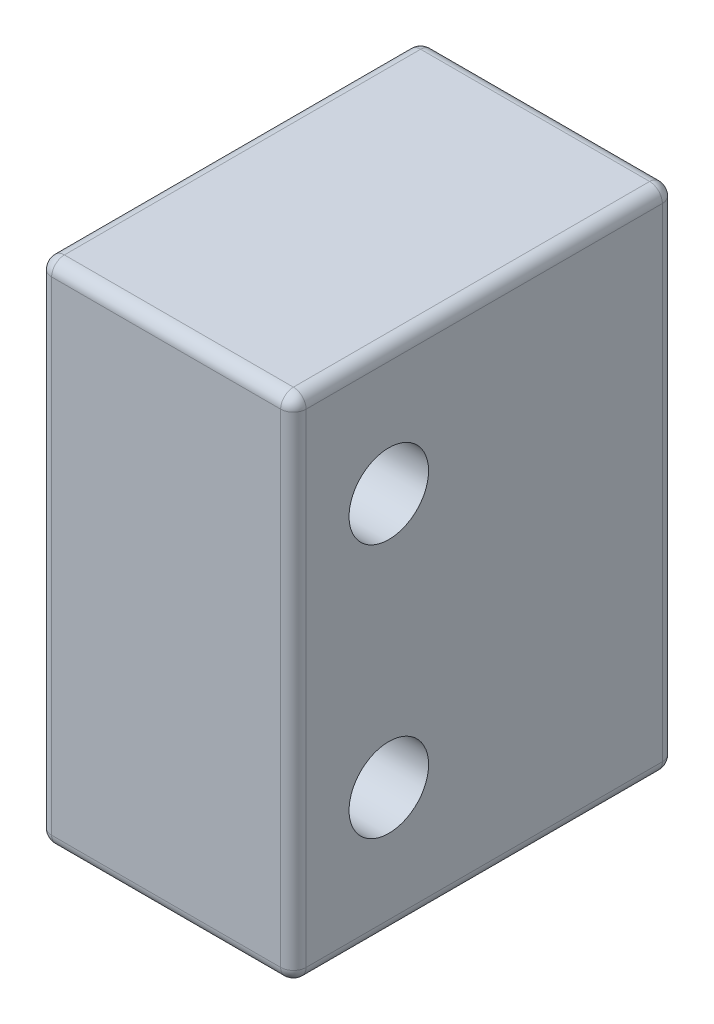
ISO-10303-21;
HEADER;
FILE_DESCRIPTION(('STEP AP214'),'2;1');
FILE_NAME('part.step','',(''),(''),'','','');
FILE_SCHEMA(('AUTOMOTIVE_DESIGN { 1 0 10303 214 1 1 1 1 }'));
ENDSEC;
DATA;
#1=APPLICATION_CONTEXT('core data for automotive mechanical design processes');
#2=APPLICATION_PROTOCOL_DEFINITION('international standard','automotive_design',2000,#1);
#3=PRODUCT_CONTEXT('',#1,'mechanical');
#4=PRODUCT('Part','Part','',(#3));
#5=PRODUCT_RELATED_PRODUCT_CATEGORY('part','',(#4));
#6=PRODUCT_DEFINITION_FORMATION('','',#4);
#7=PRODUCT_DEFINITION_CONTEXT('part definition',#1,'design');
#8=PRODUCT_DEFINITION('design','',#6,#7);
#9=PRODUCT_DEFINITION_SHAPE('','',#8);
#10=(LENGTH_UNIT() NAMED_UNIT(*) SI_UNIT(.MILLI.,.METRE.));
#11=(NAMED_UNIT(*) PLANE_ANGLE_UNIT() SI_UNIT($,.RADIAN.));
#12=(NAMED_UNIT(*) SI_UNIT($,.STERADIAN.) SOLID_ANGLE_UNIT());
#13=UNCERTAINTY_MEASURE_WITH_UNIT(LENGTH_MEASURE(1.E-05),#10,'distance_accuracy_value','');
#14=(GEOMETRIC_REPRESENTATION_CONTEXT(3) GLOBAL_UNCERTAINTY_ASSIGNED_CONTEXT((#13)) GLOBAL_UNIT_ASSIGNED_CONTEXT((#10,
#11,#12)) REPRESENTATION_CONTEXT('',''));
#15=CARTESIAN_POINT('',(0.,0.,0.));
#16=DIRECTION('',(0.,0.,1.));
#17=DIRECTION('',(1.,0.,0.));
#18=AXIS2_PLACEMENT_3D('',#15,#16,#17);
#19=CARTESIAN_POINT('',(50.8,50.8,38.1));
#20=DIRECTION('',(0.,0.,-1.));
#21=DIRECTION('',(0.,1.,0.));
#22=AXIS2_PLACEMENT_3D('',#19,#20,#21);
#23=PLANE('',#22);
#24=DIRECTION('',(0.,-1.,0.));
#25=VECTOR('',#24,1.);
#26=CARTESIAN_POINT('',(2.54,50.8,38.1));
#27=LINE('',#26,#25);
#28=CARTESIAN_POINT('',(2.54,48.26,38.1));
#29=VERTEX_POINT('',#28);
#30=CARTESIAN_POINT('',(2.54,-48.26,38.1));
#31=VERTEX_POINT('',#30);
#32=EDGE_CURVE('E178',#29,#31,#27,.T.);
#33=ORIENTED_EDGE('',*,*,#32,.T.);
#34=DIRECTION('',(-1.,0.,0.));
#35=VECTOR('',#34,1.);
#36=CARTESIAN_POINT('',(50.8,-48.26,38.1));
#37=LINE('',#36,#35);
#38=CARTESIAN_POINT('',(48.26,-48.26,38.1));
#39=VERTEX_POINT('',#38);
#40=EDGE_CURVE('E183',#31,#39,#37,.F.);
#41=ORIENTED_EDGE('',*,*,#40,.T.);
#42=DIRECTION('',(0.,-1.,0.));
#43=VECTOR('',#42,1.);
#44=CARTESIAN_POINT('',(48.26,50.8,38.1));
#45=LINE('',#44,#43);
#46=CARTESIAN_POINT('',(48.26,48.26,38.1));
#47=VERTEX_POINT('',#46);
#48=EDGE_CURVE('E180',#39,#47,#45,.F.);
#49=ORIENTED_EDGE('',*,*,#48,.T.);
#50=DIRECTION('',(-1.,0.,0.));
#51=VECTOR('',#50,1.);
#52=CARTESIAN_POINT('',(50.8,48.26,38.1));
#53=LINE('',#52,#51);
#54=EDGE_CURVE('E176',#47,#29,#53,.T.);
#55=ORIENTED_EDGE('',*,*,#54,.T.);
#56=EDGE_LOOP('',(#33,#41,#49,#55));
#57=FACE_BOUND('',#56,.T.);
#58=ADVANCED_FACE('F30',(#57),#23,.F.);
#59=CARTESIAN_POINT('',(50.8,-50.8,38.1));
#60=DIRECTION('',(0.,1.,0.));
#61=DIRECTION('',(0.,0.,1.));
#62=AXIS2_PLACEMENT_3D('',#59,#60,#61);
#63=PLANE('',#62);
#64=CARTESIAN_POINT('',(25.4,-50.8,16.51));
#65=DIRECTION('',(0.,-1.,0.));
#66=DIRECTION('',(0.,0.,-1.));
#67=AXIS2_PLACEMENT_3D('',#64,#65,#66);
#68=CIRCLE('',#67,7.9375);
#69=CARTESIAN_POINT('',(25.4,-50.8,8.57249999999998));
#70=VERTEX_POINT('',#69);
#71=EDGE_CURVE('E610',#70,#70,#68,.T.);
#72=ORIENTED_EDGE('',*,*,#71,.F.);
#73=EDGE_LOOP('',(#72));
#74=FACE_BOUND('',#73,.T.);
#75=DIRECTION('',(0.,0.,-1.));
#76=VECTOR('',#75,1.);
#77=CARTESIAN_POINT('',(48.26,-50.8,38.1));
#78=LINE('',#77,#76);
#79=CARTESIAN_POINT('',(48.26,-50.8,-35.56));
#80=VERTEX_POINT('',#79);
#81=CARTESIAN_POINT('',(48.26,-50.8,35.56));
#82=VERTEX_POINT('',#81);
#83=EDGE_CURVE('E189',#80,#82,#78,.F.);
#84=ORIENTED_EDGE('',*,*,#83,.T.);
#85=DIRECTION('',(-1.,0.,0.));
#86=VECTOR('',#85,1.);
#87=CARTESIAN_POINT('',(50.8,-50.8,35.56));
#88=LINE('',#87,#86);
#89=CARTESIAN_POINT('',(2.54,-50.8,35.56));
#90=VERTEX_POINT('',#89);
#91=EDGE_CURVE('E191',#82,#90,#88,.T.);
#92=ORIENTED_EDGE('',*,*,#91,.T.);
#93=DIRECTION('',(0.,0.,-1.));
#94=VECTOR('',#93,1.);
#95=CARTESIAN_POINT('',(2.54,-50.8,38.1));
#96=LINE('',#95,#94);
#97=CARTESIAN_POINT('',(2.54,-50.8,-35.56));
#98=VERTEX_POINT('',#97);
#99=EDGE_CURVE('E185',#90,#98,#96,.T.);
#100=ORIENTED_EDGE('',*,*,#99,.T.);
#101=DIRECTION('',(-1.,0.,0.));
#102=VECTOR('',#101,1.);
#103=CARTESIAN_POINT('',(50.8,-50.8,-35.56));
#104=LINE('',#103,#102);
#105=EDGE_CURVE('E187',#98,#80,#104,.F.);
#106=ORIENTED_EDGE('',*,*,#105,.T.);
#107=EDGE_LOOP('',(#84,#92,#100,#106));
#108=FACE_BOUND('',#107,.T.);
#109=ADVANCED_FACE('F290',(#74,#108),#63,.F.);
#110=CARTESIAN_POINT('',(50.8,50.8,-38.1));
#111=DIRECTION('',(0.,0.,1.));
#112=DIRECTION('',(0.,-1.,0.));
#113=AXIS2_PLACEMENT_3D('',#110,#111,#112);
#114=PLANE('',#113);
#115=DIRECTION('',(0.,1.,0.));
#116=VECTOR('',#115,1.);
#117=CARTESIAN_POINT('',(48.26,-50.8,-38.1));
#118=LINE('',#117,#116);
#119=CARTESIAN_POINT('',(48.26,48.26,-38.1));
#120=VERTEX_POINT('',#119);
#121=CARTESIAN_POINT('',(48.26,-48.26,-38.1));
#122=VERTEX_POINT('',#121);
#123=EDGE_CURVE('E126',#120,#122,#118,.F.);
#124=ORIENTED_EDGE('',*,*,#123,.T.);
#125=DIRECTION('',(-1.,0.,0.));
#126=VECTOR('',#125,1.);
#127=CARTESIAN_POINT('',(50.8,-48.26,-38.1));
#128=LINE('',#127,#126);
#129=CARTESIAN_POINT('',(2.54,-48.26,-38.1));
#130=VERTEX_POINT('',#129);
#131=EDGE_CURVE('E165',#122,#130,#128,.T.);
#132=ORIENTED_EDGE('',*,*,#131,.T.);
#133=DIRECTION('',(0.,1.,0.));
#134=VECTOR('',#133,1.);
#135=CARTESIAN_POINT('',(2.54,50.8,-38.1));
#136=LINE('',#135,#134);
#137=CARTESIAN_POINT('',(2.54,48.26,-38.1));
#138=VERTEX_POINT('',#137);
#139=EDGE_CURVE('E162',#130,#138,#136,.T.);
#140=ORIENTED_EDGE('',*,*,#139,.T.);
#141=DIRECTION('',(-1.,0.,0.));
#142=VECTOR('',#141,1.);
#143=CARTESIAN_POINT('',(50.8,48.26,-38.1));
#144=LINE('',#143,#142);
#145=EDGE_CURVE('E157',#138,#120,#144,.F.);
#146=ORIENTED_EDGE('',*,*,#145,.T.);
#147=EDGE_LOOP('',(#124,#132,#140,#146));
#148=FACE_BOUND('',#147,.T.);
#149=ADVANCED_FACE('F286',(#148),#114,.F.);
#150=CARTESIAN_POINT('',(50.8,50.8,38.1));
#151=DIRECTION('',(0.,-1.,0.));
#152=DIRECTION('',(0.,0.,-1.));
#153=AXIS2_PLACEMENT_3D('',#150,#151,#152);
#154=PLANE('',#153);
#155=DIRECTION('',(0.,0.,1.));
#156=VECTOR('',#155,1.);
#157=CARTESIAN_POINT('',(48.26,50.8,-38.1));
#158=LINE('',#157,#156);
#159=CARTESIAN_POINT('',(48.26,50.8,35.56));
#160=VERTEX_POINT('',#159);
#161=CARTESIAN_POINT('',(48.26,50.8,-35.56));
#162=VERTEX_POINT('',#161);
#163=EDGE_CURVE('E39',#160,#162,#158,.F.);
#164=ORIENTED_EDGE('',*,*,#163,.T.);
#165=DIRECTION('',(-1.,0.,0.));
#166=VECTOR('',#165,1.);
#167=CARTESIAN_POINT('',(50.8,50.8,-35.56));
#168=LINE('',#167,#166);
#169=CARTESIAN_POINT('',(2.54,50.8,-35.56));
#170=VERTEX_POINT('',#169);
#171=EDGE_CURVE('E11',#162,#170,#168,.T.);
#172=ORIENTED_EDGE('',*,*,#171,.T.);
#173=DIRECTION('',(0.,0.,1.));
#174=VECTOR('',#173,1.);
#175=CARTESIAN_POINT('',(2.54,50.8,38.1));
#176=LINE('',#175,#174);
#177=CARTESIAN_POINT('',(2.54,50.8,35.56));
#178=VERTEX_POINT('',#177);
#179=EDGE_CURVE('E194',#170,#178,#176,.T.);
#180=ORIENTED_EDGE('',*,*,#179,.T.);
#181=DIRECTION('',(-1.,0.,0.));
#182=VECTOR('',#181,1.);
#183=CARTESIAN_POINT('',(50.8,50.8,35.56));
#184=LINE('',#183,#182);
#185=EDGE_CURVE('E50',#178,#160,#184,.F.);
#186=ORIENTED_EDGE('',*,*,#185,.T.);
#187=EDGE_LOOP('',(#164,#172,#180,#186));
#188=FACE_BOUND('',#187,.T.);
#189=ADVANCED_FACE('F278',(#188),#154,.F.);
#190=CARTESIAN_POINT('',(50.8,50.8,38.1));
#191=DIRECTION('',(1.,0.,0.));
#192=DIRECTION('',(0.,0.,-1.));
#193=AXIS2_PLACEMENT_3D('',#190,#191,#192);
#194=PLANE('',#193);
#195=DIRECTION('',(0.,-1.,0.));
#196=VECTOR('',#195,1.);
#197=CARTESIAN_POINT('',(50.8,-50.8,35.56));
#198=LINE('',#197,#196);
#199=CARTESIAN_POINT('',(50.8,48.26,35.56));
#200=VERTEX_POINT('',#199);
#201=CARTESIAN_POINT('',(50.8,-48.26,35.56));
#202=VERTEX_POINT('',#201);
#203=EDGE_CURVE('E148',#200,#202,#198,.T.);
#204=ORIENTED_EDGE('',*,*,#203,.T.);
#205=DIRECTION('',(0.,0.,-1.));
#206=VECTOR('',#205,1.);
#207=CARTESIAN_POINT('',(50.8,-48.26,-38.1));
#208=LINE('',#207,#206);
#209=CARTESIAN_POINT('',(50.8,-48.26,-35.56));
#210=VERTEX_POINT('',#209);
#211=EDGE_CURVE('E154',#202,#210,#208,.T.);
#212=ORIENTED_EDGE('',*,*,#211,.T.);
#213=DIRECTION('',(0.,1.,0.));
#214=VECTOR('',#213,1.);
#215=CARTESIAN_POINT('',(50.8,50.8,-35.56));
#216=LINE('',#215,#214);
#217=CARTESIAN_POINT('',(50.8,48.26,-35.56));
#218=VERTEX_POINT('',#217);
#219=EDGE_CURVE('E124',#210,#218,#216,.T.);
#220=ORIENTED_EDGE('',*,*,#219,.T.);
#221=DIRECTION('',(0.,0.,1.));
#222=VECTOR('',#221,1.);
#223=CARTESIAN_POINT('',(50.8,48.26,38.1));
#224=LINE('',#223,#222);
#225=EDGE_CURVE('E142',#218,#200,#224,.T.);
#226=ORIENTED_EDGE('',*,*,#225,.T.);
#227=EDGE_LOOP('',(#204,#212,#220,#226));
#228=FACE_BOUND('',#227,.T.);
#229=CARTESIAN_POINT('',(50.8,-25.4,19.05));
#230=DIRECTION('',(1.,0.,0.));
#231=DIRECTION('',(0.,0.,-1.));
#232=AXIS2_PLACEMENT_3D('',#229,#230,#231);
#233=CIRCLE('',#232,7.9375);
#234=CARTESIAN_POINT('',(50.8,-25.4,11.1125));
#235=VERTEX_POINT('',#234);
#236=EDGE_CURVE('E254',#235,#235,#233,.T.);
#237=ORIENTED_EDGE('',*,*,#236,.F.);
#238=EDGE_LOOP('',(#237));
#239=FACE_BOUND('',#238,.T.);
#240=CARTESIAN_POINT('',(50.8,25.4,19.05));
#241=DIRECTION('',(1.,0.,0.));
#242=DIRECTION('',(0.,0.,-1.));
#243=AXIS2_PLACEMENT_3D('',#240,#241,#242);
#244=CIRCLE('',#243,7.9375);
#245=CARTESIAN_POINT('',(50.8,25.4,11.1125));
#246=VERTEX_POINT('',#245);
#247=EDGE_CURVE('E265',#246,#246,#244,.T.);
#248=ORIENTED_EDGE('',*,*,#247,.F.);
#249=EDGE_LOOP('',(#248));
#250=FACE_BOUND('',#249,.T.);
#251=ADVANCED_FACE('F151',(#228,#239,#250),#194,.T.);
#252=CARTESIAN_POINT('',(0.,50.8,38.1));
#253=DIRECTION('',(1.,0.,0.));
#254=DIRECTION('',(0.,0.,-1.));
#255=AXIS2_PLACEMENT_3D('',#252,#253,#254);
#256=PLANE('',#255);
#257=DIRECTION('',(0.,1.,0.));
#258=VECTOR('',#257,1.);
#259=CARTESIAN_POINT('',(0.,50.8,-35.56));
#260=LINE('',#259,#258);
#261=CARTESIAN_POINT('',(0.,48.26,-35.56));
#262=VERTEX_POINT('',#261);
#263=CARTESIAN_POINT('',(0.,-48.26,-35.56));
#264=VERTEX_POINT('',#263);
#265=EDGE_CURVE('E171',#262,#264,#260,.F.);
#266=ORIENTED_EDGE('',*,*,#265,.T.);
#267=DIRECTION('',(0.,0.,-1.));
#268=VECTOR('',#267,1.);
#269=CARTESIAN_POINT('',(0.,-48.26,38.1));
#270=LINE('',#269,#268);
#271=CARTESIAN_POINT('',(0.,-48.26,35.56));
#272=VERTEX_POINT('',#271);
#273=EDGE_CURVE('E174',#264,#272,#270,.F.);
#274=ORIENTED_EDGE('',*,*,#273,.T.);
#275=DIRECTION('',(0.,-1.,0.));
#276=VECTOR('',#275,1.);
#277=CARTESIAN_POINT('',(0.,50.8,35.56));
#278=LINE('',#277,#276);
#279=CARTESIAN_POINT('',(0.,48.26,35.56));
#280=VERTEX_POINT('',#279);
#281=EDGE_CURVE('E169',#272,#280,#278,.F.);
#282=ORIENTED_EDGE('',*,*,#281,.T.);
#283=DIRECTION('',(0.,0.,1.));
#284=VECTOR('',#283,1.);
#285=CARTESIAN_POINT('',(0.,48.26,38.1));
#286=LINE('',#285,#284);
#287=EDGE_CURVE('E167',#280,#262,#286,.F.);
#288=ORIENTED_EDGE('',*,*,#287,.T.);
#289=EDGE_LOOP('',(#266,#274,#282,#288));
#290=FACE_BOUND('',#289,.T.);
#291=ADVANCED_FACE('F277',(#290),#256,.F.);
#292=CARTESIAN_POINT('',(25.4,25.4,19.05));
#293=DIRECTION('',(1.,0.,0.));
#294=DIRECTION('',(0.,0.,-1.));
#295=AXIS2_PLACEMENT_3D('',#292,#293,#294);
#296=CYLINDRICAL_SURFACE('',#295,7.9375);
#297=CARTESIAN_POINT('',(25.4,25.4,19.05));
#298=DIRECTION('',(1.,0.,0.));
#299=DIRECTION('',(0.,0.,-1.));
#300=AXIS2_PLACEMENT_3D('',#297,#298,#299);
#301=CIRCLE('',#300,7.9375);
#302=CARTESIAN_POINT('',(25.4,25.4,11.1125));
#303=VERTEX_POINT('',#302);
#304=EDGE_CURVE('E149',#303,#303,#301,.T.);
#305=ORIENTED_EDGE('',*,*,#304,.F.);
#306=EDGE_LOOP('',(#305));
#307=FACE_BOUND('',#306,.T.);
#308=ORIENTED_EDGE('',*,*,#247,.T.);
#309=EDGE_LOOP('',(#308));
#310=FACE_BOUND('',#309,.T.);
#311=ADVANCED_FACE('F274',(#307,#310),#296,.F.);
#312=CARTESIAN_POINT('',(25.4,25.4,19.05));
#313=DIRECTION('',(1.,0.,0.));
#314=DIRECTION('',(0.,0.,-1.));
#315=AXIS2_PLACEMENT_3D('',#312,#313,#314);
#316=PLANE('',#315);
#317=ORIENTED_EDGE('',*,*,#304,.T.);
#318=EDGE_LOOP('',(#317));
#319=FACE_BOUND('',#318,.T.);
#320=ADVANCED_FACE('F577',(#319),#316,.T.);
#321=CARTESIAN_POINT('',(25.4,-25.4,19.05));
#322=DIRECTION('',(1.,0.,0.));
#323=DIRECTION('',(0.,0.,-1.));
#324=AXIS2_PLACEMENT_3D('',#321,#322,#323);
#325=CYLINDRICAL_SURFACE('',#324,7.9375);
#326=CARTESIAN_POINT('',(25.4,-25.4,19.05));
#327=DIRECTION('',(1.,0.,0.));
#328=DIRECTION('',(0.,0.,-1.));
#329=AXIS2_PLACEMENT_3D('',#326,#327,#328);
#330=CIRCLE('',#329,7.9375);
#331=CARTESIAN_POINT('',(25.4,-25.4,11.1125));
#332=VERTEX_POINT('',#331);
#333=EDGE_CURVE('E260',#332,#332,#330,.T.);
#334=ORIENTED_EDGE('',*,*,#333,.F.);
#335=EDGE_LOOP('',(#334));
#336=FACE_BOUND('',#335,.T.);
#337=ORIENTED_EDGE('',*,*,#236,.T.);
#338=EDGE_LOOP('',(#337));
#339=FACE_BOUND('',#338,.T.);
#340=ADVANCED_FACE('F573',(#336,#339),#325,.F.);
#341=CARTESIAN_POINT('',(25.4,-25.4,19.05));
#342=DIRECTION('',(1.,0.,0.));
#343=DIRECTION('',(0.,0.,-1.));
#344=AXIS2_PLACEMENT_3D('',#341,#342,#343);
#345=PLANE('',#344);
#346=ORIENTED_EDGE('',*,*,#333,.T.);
#347=EDGE_LOOP('',(#346));
#348=FACE_BOUND('',#347,.T.);
#349=ADVANCED_FACE('F370',(#348),#345,.T.);
#350=CARTESIAN_POINT('',(2.54,50.8,35.56));
#351=DIRECTION('',(0.,-1.,0.));
#352=DIRECTION('',(0.,0.,-1.));
#353=AXIS2_PLACEMENT_3D('',#350,#351,#352);
#354=CYLINDRICAL_SURFACE('',#353,2.54);
#355=CARTESIAN_POINT('',(2.54,-48.26,35.56));
#356=DIRECTION('',(0.,-1.,0.));
#357=DIRECTION('',(0.,0.,-1.));
#358=AXIS2_PLACEMENT_3D('',#355,#356,#357);
#359=CIRCLE('',#358,2.54);
#360=EDGE_CURVE('E34',#31,#272,#359,.T.);
#361=ORIENTED_EDGE('',*,*,#360,.F.);
#362=ORIENTED_EDGE('',*,*,#32,.F.);
#363=CARTESIAN_POINT('',(2.54,48.26,35.56));
#364=DIRECTION('',(0.,1.,0.));
#365=DIRECTION('',(0.,0.,1.));
#366=AXIS2_PLACEMENT_3D('',#363,#364,#365);
#367=CIRCLE('',#366,2.54);
#368=EDGE_CURVE('E247',#280,#29,#367,.T.);
#369=ORIENTED_EDGE('',*,*,#368,.F.);
#370=ORIENTED_EDGE('',*,*,#281,.F.);
#371=EDGE_LOOP('',(#361,#362,#369,#370));
#372=FACE_BOUND('',#371,.T.);
#373=ADVANCED_FACE('F32',(#372),#354,.T.);
#374=CARTESIAN_POINT('',(2.54,-48.26,35.56));
#375=DIRECTION('',(0.,0.,1.));
#376=DIRECTION('',(1.,0.,0.));
#377=AXIS2_PLACEMENT_3D('',#374,#375,#376);
#378=SPHERICAL_SURFACE('',#377,2.54);
#379=CARTESIAN_POINT('',(2.54,-48.26,35.56));
#380=DIRECTION('',(-1.,0.,0.));
#381=DIRECTION('',(0.,0.,1.));
#382=AXIS2_PLACEMENT_3D('',#379,#380,#381);
#383=CIRCLE('',#382,2.54);
#384=EDGE_CURVE('E242',#31,#90,#383,.F.);
#385=ORIENTED_EDGE('',*,*,#384,.F.);
#386=ORIENTED_EDGE('',*,*,#360,.T.);
#387=CARTESIAN_POINT('',(2.54,-48.26,35.56));
#388=DIRECTION('',(0.,0.,1.));
#389=DIRECTION('',(1.,0.,0.));
#390=AXIS2_PLACEMENT_3D('',#387,#388,#389);
#391=CIRCLE('',#390,2.54);
#392=EDGE_CURVE('E245',#90,#272,#391,.F.);
#393=ORIENTED_EDGE('',*,*,#392,.F.);
#394=EDGE_LOOP('',(#385,#386,#393));
#395=FACE_BOUND('',#394,.T.);
#396=ADVANCED_FACE('F365',(#395),#378,.T.);
#397=CARTESIAN_POINT('',(2.54,48.26,35.56));
#398=DIRECTION('',(0.,0.,1.));
#399=DIRECTION('',(1.,0.,0.));
#400=AXIS2_PLACEMENT_3D('',#397,#398,#399);
#401=SPHERICAL_SURFACE('',#400,2.54);
#402=CARTESIAN_POINT('',(2.54,48.26,35.56));
#403=DIRECTION('',(0.,0.,1.));
#404=DIRECTION('',(1.,0.,0.));
#405=AXIS2_PLACEMENT_3D('',#402,#403,#404);
#406=CIRCLE('',#405,2.54);
#407=EDGE_CURVE('E236',#280,#178,#406,.F.);
#408=ORIENTED_EDGE('',*,*,#407,.F.);
#409=ORIENTED_EDGE('',*,*,#368,.T.);
#410=CARTESIAN_POINT('',(2.54,48.26,35.56));
#411=DIRECTION('',(-1.,0.,0.));
#412=DIRECTION('',(0.,0.,1.));
#413=AXIS2_PLACEMENT_3D('',#410,#411,#412);
#414=CIRCLE('',#413,2.54);
#415=EDGE_CURVE('E239',#178,#29,#414,.F.);
#416=ORIENTED_EDGE('',*,*,#415,.F.);
#417=EDGE_LOOP('',(#408,#409,#416));
#418=FACE_BOUND('',#417,.T.);
#419=ADVANCED_FACE('F362',(#418),#401,.T.);
#420=CARTESIAN_POINT('',(2.54,-48.26,38.1));
#421=DIRECTION('',(0.,0.,-1.));
#422=DIRECTION('',(-1.,0.,0.));
#423=AXIS2_PLACEMENT_3D('',#420,#421,#422);
#424=CYLINDRICAL_SURFACE('',#423,2.54);
#425=ORIENTED_EDGE('',*,*,#392,.T.);
#426=ORIENTED_EDGE('',*,*,#273,.F.);
#427=CARTESIAN_POINT('',(2.54,-48.26,-35.56));
#428=DIRECTION('',(0.,0.,-1.));
#429=DIRECTION('',(-1.,0.,0.));
#430=AXIS2_PLACEMENT_3D('',#427,#428,#429);
#431=CIRCLE('',#430,2.54);
#432=EDGE_CURVE('E231',#98,#264,#431,.T.);
#433=ORIENTED_EDGE('',*,*,#432,.F.);
#434=ORIENTED_EDGE('',*,*,#99,.F.);
#435=EDGE_LOOP('',(#425,#426,#433,#434));
#436=FACE_BOUND('',#435,.T.);
#437=ADVANCED_FACE('F358',(#436),#424,.T.);
#438=CARTESIAN_POINT('',(50.8,-48.26,35.56));
#439=DIRECTION('',(-1.,0.,0.));
#440=DIRECTION('',(0.,0.,1.));
#441=AXIS2_PLACEMENT_3D('',#438,#439,#440);
#442=CYLINDRICAL_SURFACE('',#441,2.54);
#443=ORIENTED_EDGE('',*,*,#384,.T.);
#444=ORIENTED_EDGE('',*,*,#91,.F.);
#445=CARTESIAN_POINT('',(48.26,-48.26,35.56));
#446=DIRECTION('',(1.,0.,0.));
#447=DIRECTION('',(0.,0.,-1.));
#448=AXIS2_PLACEMENT_3D('',#445,#446,#447);
#449=CIRCLE('',#448,2.54);
#450=EDGE_CURVE('E228',#39,#82,#449,.T.);
#451=ORIENTED_EDGE('',*,*,#450,.F.);
#452=ORIENTED_EDGE('',*,*,#40,.F.);
#453=EDGE_LOOP('',(#443,#444,#451,#452));
#454=FACE_BOUND('',#453,.T.);
#455=ADVANCED_FACE('F354',(#454),#442,.T.);
#456=CARTESIAN_POINT('',(48.26,50.8,35.56));
#457=DIRECTION('',(0.,1.,0.));
#458=DIRECTION('',(0.,0.,1.));
#459=AXIS2_PLACEMENT_3D('',#456,#457,#458);
#460=CYLINDRICAL_SURFACE('',#459,2.54);
#461=CARTESIAN_POINT('',(48.26,48.26,35.56));
#462=DIRECTION('',(0.,1.,0.));
#463=DIRECTION('',(0.,0.,1.));
#464=AXIS2_PLACEMENT_3D('',#461,#462,#463);
#465=CIRCLE('',#464,2.54);
#466=EDGE_CURVE('E222',#47,#200,#465,.T.);
#467=ORIENTED_EDGE('',*,*,#466,.F.);
#468=ORIENTED_EDGE('',*,*,#48,.F.);
#469=CARTESIAN_POINT('',(48.26,-48.26,35.56));
#470=DIRECTION('',(0.,-1.,0.));
#471=DIRECTION('',(0.,0.,-1.));
#472=AXIS2_PLACEMENT_3D('',#469,#470,#471);
#473=CIRCLE('',#472,2.54);
#474=EDGE_CURVE('E225',#202,#39,#473,.T.);
#475=ORIENTED_EDGE('',*,*,#474,.F.);
#476=ORIENTED_EDGE('',*,*,#203,.F.);
#477=EDGE_LOOP('',(#467,#468,#475,#476));
#478=FACE_BOUND('',#477,.T.);
#479=ADVANCED_FACE('F350',(#478),#460,.T.);
#480=CARTESIAN_POINT('',(50.8,48.26,35.56));
#481=DIRECTION('',(-1.,0.,0.));
#482=DIRECTION('',(0.,0.,1.));
#483=AXIS2_PLACEMENT_3D('',#480,#481,#482);
#484=CYLINDRICAL_SURFACE('',#483,2.54);
#485=ORIENTED_EDGE('',*,*,#415,.T.);
#486=ORIENTED_EDGE('',*,*,#54,.F.);
#487=CARTESIAN_POINT('',(48.26,48.26,35.56));
#488=DIRECTION('',(1.,0.,0.));
#489=DIRECTION('',(0.,0.,-1.));
#490=AXIS2_PLACEMENT_3D('',#487,#488,#489);
#491=CIRCLE('',#490,2.54);
#492=EDGE_CURVE('E220',#160,#47,#491,.T.);
#493=ORIENTED_EDGE('',*,*,#492,.F.);
#494=ORIENTED_EDGE('',*,*,#185,.F.);
#495=EDGE_LOOP('',(#485,#486,#493,#494));
#496=FACE_BOUND('',#495,.T.);
#497=ADVANCED_FACE('F346',(#496),#484,.T.);
#498=CARTESIAN_POINT('',(2.54,48.26,38.1));
#499=DIRECTION('',(0.,0.,1.));
#500=DIRECTION('',(0.,-1.,0.));
#501=AXIS2_PLACEMENT_3D('',#498,#499,#500);
#502=CYLINDRICAL_SURFACE('',#501,2.54);
#503=ORIENTED_EDGE('',*,*,#407,.T.);
#504=ORIENTED_EDGE('',*,*,#179,.F.);
#505=CARTESIAN_POINT('',(2.54,48.26,-35.56));
#506=DIRECTION('',(0.,0.,-1.));
#507=DIRECTION('',(-1.,0.,0.));
#508=AXIS2_PLACEMENT_3D('',#505,#506,#507);
#509=CIRCLE('',#508,2.54);
#510=EDGE_CURVE('E217',#262,#170,#509,.T.);
#511=ORIENTED_EDGE('',*,*,#510,.F.);
#512=ORIENTED_EDGE('',*,*,#287,.F.);
#513=EDGE_LOOP('',(#503,#504,#511,#512));
#514=FACE_BOUND('',#513,.T.);
#515=ADVANCED_FACE('F342',(#514),#502,.T.);
#516=CARTESIAN_POINT('',(2.54,50.8,-35.56));
#517=DIRECTION('',(0.,1.,0.));
#518=DIRECTION('',(0.,0.,1.));
#519=AXIS2_PLACEMENT_3D('',#516,#517,#518);
#520=CYLINDRICAL_SURFACE('',#519,2.54);
#521=CARTESIAN_POINT('',(2.54,-48.26,-35.56));
#522=DIRECTION('',(0.,-1.,0.));
#523=DIRECTION('',(0.,0.,-1.));
#524=AXIS2_PLACEMENT_3D('',#521,#522,#523);
#525=CIRCLE('',#524,2.54);
#526=EDGE_CURVE('E233',#264,#130,#525,.T.);
#527=ORIENTED_EDGE('',*,*,#526,.F.);
#528=ORIENTED_EDGE('',*,*,#265,.F.);
#529=CARTESIAN_POINT('',(2.54,48.26,-35.56));
#530=DIRECTION('',(0.,1.,0.));
#531=DIRECTION('',(0.,0.,1.));
#532=AXIS2_PLACEMENT_3D('',#529,#530,#531);
#533=CIRCLE('',#532,2.54);
#534=EDGE_CURVE('E214',#138,#262,#533,.T.);
#535=ORIENTED_EDGE('',*,*,#534,.F.);
#536=ORIENTED_EDGE('',*,*,#139,.F.);
#537=EDGE_LOOP('',(#527,#528,#535,#536));
#538=FACE_BOUND('',#537,.T.);
#539=ADVANCED_FACE('F338',(#538),#520,.T.);
#540=CARTESIAN_POINT('',(2.54,-48.26,-35.56));
#541=DIRECTION('',(0.,0.,1.));
#542=DIRECTION('',(1.,0.,0.));
#543=AXIS2_PLACEMENT_3D('',#540,#541,#542);
#544=SPHERICAL_SURFACE('',#543,2.54);
#545=ORIENTED_EDGE('',*,*,#432,.T.);
#546=ORIENTED_EDGE('',*,*,#526,.T.);
#547=CARTESIAN_POINT('',(2.54,-48.26,-35.56));
#548=DIRECTION('',(-1.,0.,0.));
#549=DIRECTION('',(0.,0.,1.));
#550=AXIS2_PLACEMENT_3D('',#547,#548,#549);
#551=CIRCLE('',#550,2.54);
#552=EDGE_CURVE('E211',#98,#130,#551,.F.);
#553=ORIENTED_EDGE('',*,*,#552,.F.);
#554=EDGE_LOOP('',(#545,#546,#553));
#555=FACE_BOUND('',#554,.T.);
#556=ADVANCED_FACE('F334',(#555),#544,.T.);
#557=CARTESIAN_POINT('',(48.26,-48.26,35.56));
#558=DIRECTION('',(0.,0.,1.));
#559=DIRECTION('',(1.,0.,0.));
#560=AXIS2_PLACEMENT_3D('',#557,#558,#559);
#561=SPHERICAL_SURFACE('',#560,2.54);
#562=ORIENTED_EDGE('',*,*,#474,.T.);
#563=ORIENTED_EDGE('',*,*,#450,.T.);
#564=CARTESIAN_POINT('',(48.26,-48.26,35.56));
#565=DIRECTION('',(0.,0.,1.));
#566=DIRECTION('',(1.,0.,0.));
#567=AXIS2_PLACEMENT_3D('',#564,#565,#566);
#568=CIRCLE('',#567,2.54);
#569=EDGE_CURVE('E208',#202,#82,#568,.F.);
#570=ORIENTED_EDGE('',*,*,#569,.F.);
#571=EDGE_LOOP('',(#562,#563,#570));
#572=FACE_BOUND('',#571,.T.);
#573=ADVANCED_FACE('F330',(#572),#561,.T.);
#574=CARTESIAN_POINT('',(48.26,48.26,35.56));
#575=DIRECTION('',(0.,0.,1.));
#576=DIRECTION('',(1.,0.,0.));
#577=AXIS2_PLACEMENT_3D('',#574,#575,#576);
#578=SPHERICAL_SURFACE('',#577,2.54);
#579=ORIENTED_EDGE('',*,*,#492,.T.);
#580=ORIENTED_EDGE('',*,*,#466,.T.);
#581=CARTESIAN_POINT('',(48.26,48.26,35.56));
#582=DIRECTION('',(0.,0.,1.));
#583=DIRECTION('',(1.,0.,0.));
#584=AXIS2_PLACEMENT_3D('',#581,#582,#583);
#585=CIRCLE('',#584,2.54);
#586=EDGE_CURVE('E145',#160,#200,#585,.F.);
#587=ORIENTED_EDGE('',*,*,#586,.F.);
#588=EDGE_LOOP('',(#579,#580,#587));
#589=FACE_BOUND('',#588,.T.);
#590=ADVANCED_FACE('F326',(#589),#578,.T.);
#591=CARTESIAN_POINT('',(2.54,48.26,-35.56));
#592=DIRECTION('',(0.,0.,1.));
#593=DIRECTION('',(1.,0.,0.));
#594=AXIS2_PLACEMENT_3D('',#591,#592,#593);
#595=SPHERICAL_SURFACE('',#594,2.54);
#596=ORIENTED_EDGE('',*,*,#534,.T.);
#597=ORIENTED_EDGE('',*,*,#510,.T.);
#598=CARTESIAN_POINT('',(2.54,48.26,-35.56));
#599=DIRECTION('',(-1.,0.,0.));
#600=DIRECTION('',(0.,0.,1.));
#601=AXIS2_PLACEMENT_3D('',#598,#599,#600);
#602=CIRCLE('',#601,2.54);
#603=EDGE_CURVE('E205',#138,#170,#602,.F.);
#604=ORIENTED_EDGE('',*,*,#603,.F.);
#605=EDGE_LOOP('',(#596,#597,#604));
#606=FACE_BOUND('',#605,.T.);
#607=ADVANCED_FACE('F322',(#606),#595,.T.);
#608=CARTESIAN_POINT('',(50.8,-48.26,-35.56));
#609=DIRECTION('',(-1.,0.,0.));
#610=DIRECTION('',(0.,0.,1.));
#611=AXIS2_PLACEMENT_3D('',#608,#609,#610);
#612=CYLINDRICAL_SURFACE('',#611,2.54);
#613=ORIENTED_EDGE('',*,*,#552,.T.);
#614=ORIENTED_EDGE('',*,*,#131,.F.);
#615=CARTESIAN_POINT('',(48.26,-48.26,-35.56));
#616=DIRECTION('',(1.,0.,0.));
#617=DIRECTION('',(0.,0.,-1.));
#618=AXIS2_PLACEMENT_3D('',#615,#616,#617);
#619=CIRCLE('',#618,2.54);
#620=EDGE_CURVE('E202',#80,#122,#619,.T.);
#621=ORIENTED_EDGE('',*,*,#620,.F.);
#622=ORIENTED_EDGE('',*,*,#105,.F.);
#623=EDGE_LOOP('',(#613,#614,#621,#622));
#624=FACE_BOUND('',#623,.T.);
#625=ADVANCED_FACE('F318',(#624),#612,.T.);
#626=CARTESIAN_POINT('',(48.26,-48.26,38.1));
#627=DIRECTION('',(0.,0.,1.));
#628=DIRECTION('',(1.,0.,0.));
#629=AXIS2_PLACEMENT_3D('',#626,#627,#628);
#630=CYLINDRICAL_SURFACE('',#629,2.54);
#631=ORIENTED_EDGE('',*,*,#569,.T.);
#632=ORIENTED_EDGE('',*,*,#83,.F.);
#633=CARTESIAN_POINT('',(48.26,-48.26,-35.56));
#634=DIRECTION('',(0.,0.,-1.));
#635=DIRECTION('',(-1.,0.,0.));
#636=AXIS2_PLACEMENT_3D('',#633,#634,#635);
#637=CIRCLE('',#636,2.54);
#638=EDGE_CURVE('E139',#210,#80,#637,.T.);
#639=ORIENTED_EDGE('',*,*,#638,.F.);
#640=ORIENTED_EDGE('',*,*,#211,.F.);
#641=EDGE_LOOP('',(#631,#632,#639,#640));
#642=FACE_BOUND('',#641,.T.);
#643=ADVANCED_FACE('F315',(#642),#630,.T.);
#644=CARTESIAN_POINT('',(48.26,48.26,38.1));
#645=DIRECTION('',(0.,0.,-1.));
#646=DIRECTION('',(0.,1.,0.));
#647=AXIS2_PLACEMENT_3D('',#644,#645,#646);
#648=CYLINDRICAL_SURFACE('',#647,2.54);
#649=ORIENTED_EDGE('',*,*,#586,.T.);
#650=ORIENTED_EDGE('',*,*,#225,.F.);
#651=CARTESIAN_POINT('',(48.26,48.26,-35.56));
#652=DIRECTION('',(0.,0.,-1.));
#653=DIRECTION('',(-1.,0.,0.));
#654=AXIS2_PLACEMENT_3D('',#651,#652,#653);
#655=CIRCLE('',#654,2.54);
#656=EDGE_CURVE('E133',#162,#218,#655,.T.);
#657=ORIENTED_EDGE('',*,*,#656,.F.);
#658=ORIENTED_EDGE('',*,*,#163,.F.);
#659=EDGE_LOOP('',(#649,#650,#657,#658));
#660=FACE_BOUND('',#659,.T.);
#661=ADVANCED_FACE('F143',(#660),#648,.T.);
#662=CARTESIAN_POINT('',(50.8,48.26,-35.56));
#663=DIRECTION('',(-1.,0.,0.));
#664=DIRECTION('',(0.,0.,1.));
#665=AXIS2_PLACEMENT_3D('',#662,#663,#664);
#666=CYLINDRICAL_SURFACE('',#665,2.54);
#667=ORIENTED_EDGE('',*,*,#603,.T.);
#668=ORIENTED_EDGE('',*,*,#171,.F.);
#669=CARTESIAN_POINT('',(48.26,48.26,-35.56));
#670=DIRECTION('',(1.,0.,0.));
#671=DIRECTION('',(0.,0.,-1.));
#672=AXIS2_PLACEMENT_3D('',#669,#670,#671);
#673=CIRCLE('',#672,2.54);
#674=EDGE_CURVE('E137',#120,#162,#673,.T.);
#675=ORIENTED_EDGE('',*,*,#674,.F.);
#676=ORIENTED_EDGE('',*,*,#145,.F.);
#677=EDGE_LOOP('',(#667,#668,#675,#676));
#678=FACE_BOUND('',#677,.T.);
#679=ADVANCED_FACE('F308',(#678),#666,.T.);
#680=CARTESIAN_POINT('',(48.26,-48.26,-35.56));
#681=DIRECTION('',(0.,0.,1.));
#682=DIRECTION('',(1.,0.,0.));
#683=AXIS2_PLACEMENT_3D('',#680,#681,#682);
#684=SPHERICAL_SURFACE('',#683,2.54);
#685=ORIENTED_EDGE('',*,*,#638,.T.);
#686=ORIENTED_EDGE('',*,*,#620,.T.);
#687=CARTESIAN_POINT('',(48.26,-48.26,-35.56));
#688=DIRECTION('',(0.,-1.,0.));
#689=DIRECTION('',(1.,0.,0.));
#690=AXIS2_PLACEMENT_3D('',#687,#688,#689);
#691=CIRCLE('',#690,2.54);
#692=EDGE_CURVE('E129',#210,#122,#691,.F.);
#693=ORIENTED_EDGE('',*,*,#692,.F.);
#694=EDGE_LOOP('',(#685,#686,#693));
#695=FACE_BOUND('',#694,.T.);
#696=ADVANCED_FACE('F305',(#695),#684,.T.);
#697=CARTESIAN_POINT('',(48.26,48.26,-35.56));
#698=DIRECTION('',(0.,0.,1.));
#699=DIRECTION('',(1.,0.,0.));
#700=AXIS2_PLACEMENT_3D('',#697,#698,#699);
#701=SPHERICAL_SURFACE('',#700,2.54);
#702=ORIENTED_EDGE('',*,*,#674,.T.);
#703=ORIENTED_EDGE('',*,*,#656,.T.);
#704=CARTESIAN_POINT('',(48.26,48.26,-35.56));
#705=DIRECTION('',(0.,1.,0.));
#706=DIRECTION('',(0.,0.,1.));
#707=AXIS2_PLACEMENT_3D('',#704,#705,#706);
#708=CIRCLE('',#707,2.54);
#709=EDGE_CURVE('E120',#120,#218,#708,.F.);
#710=ORIENTED_EDGE('',*,*,#709,.F.);
#711=EDGE_LOOP('',(#702,#703,#710));
#712=FACE_BOUND('',#711,.T.);
#713=ADVANCED_FACE('F135',(#712),#701,.T.);
#714=CARTESIAN_POINT('',(48.26,50.8,-35.56));
#715=DIRECTION('',(0.,-1.,0.));
#716=DIRECTION('',(0.,0.,-1.));
#717=AXIS2_PLACEMENT_3D('',#714,#715,#716);
#718=CYLINDRICAL_SURFACE('',#717,2.54);
#719=ORIENTED_EDGE('',*,*,#692,.T.);
#720=ORIENTED_EDGE('',*,*,#123,.F.);
#721=ORIENTED_EDGE('',*,*,#709,.T.);
#722=ORIENTED_EDGE('',*,*,#219,.F.);
#723=EDGE_LOOP('',(#719,#720,#721,#722));
#724=FACE_BOUND('',#723,.T.);
#725=ADVANCED_FACE('F122',(#724),#718,.T.);
#726=CARTESIAN_POINT('',(25.4,-38.1,16.51));
#727=DIRECTION('',(0.,-1.,0.));
#728=DIRECTION('',(0.,0.,-1.));
#729=AXIS2_PLACEMENT_3D('',#726,#727,#728);
#730=CYLINDRICAL_SURFACE('',#729,7.9375);
#731=CARTESIAN_POINT('',(25.4,-38.1,16.51));
#732=DIRECTION('',(0.,-1.,0.));
#733=DIRECTION('',(0.,0.,-1.));
#734=AXIS2_PLACEMENT_3D('',#731,#732,#733);
#735=CIRCLE('',#734,7.9375);
#736=CARTESIAN_POINT('',(25.4,-38.1,8.57249999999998));
#737=VERTEX_POINT('',#736);
#738=EDGE_CURVE('E130',#737,#737,#735,.T.);
#739=ORIENTED_EDGE('',*,*,#738,.F.);
#740=EDGE_LOOP('',(#739));
#741=FACE_BOUND('',#740,.T.);
#742=ORIENTED_EDGE('',*,*,#71,.T.);
#743=EDGE_LOOP('',(#742));
#744=FACE_BOUND('',#743,.T.);
#745=ADVANCED_FACE('F302',(#741,#744),#730,.F.);
#746=CARTESIAN_POINT('',(25.4,-38.1,16.51));
#747=DIRECTION('',(0.,-1.,0.));
#748=DIRECTION('',(0.,0.,-1.));
#749=AXIS2_PLACEMENT_3D('',#746,#747,#748);
#750=PLANE('',#749);
#751=ORIENTED_EDGE('',*,*,#738,.T.);
#752=EDGE_LOOP('',(#751));
#753=FACE_BOUND('',#752,.T.);
#754=ADVANCED_FACE('F556',(#753),#750,.T.);
#755=CLOSED_SHELL('',(#58,#109,#149,#189,#251,#291,#311,#320,#340,#349,#373,#396,#419,#437,#455,
#479,#497,#515,#539,#556,#573,#590,#607,#625,#643,#661,#679,#696,#713,#725,#745,#754));
#756=MANIFOLD_SOLID_BREP('B2',#755);
#757=ADVANCED_BREP_SHAPE_REPRESENTATION('',(#18,#756),#14);
#758=SHAPE_DEFINITION_REPRESENTATION(#9,#757);
ENDSEC;
END-ISO-10303-21;
